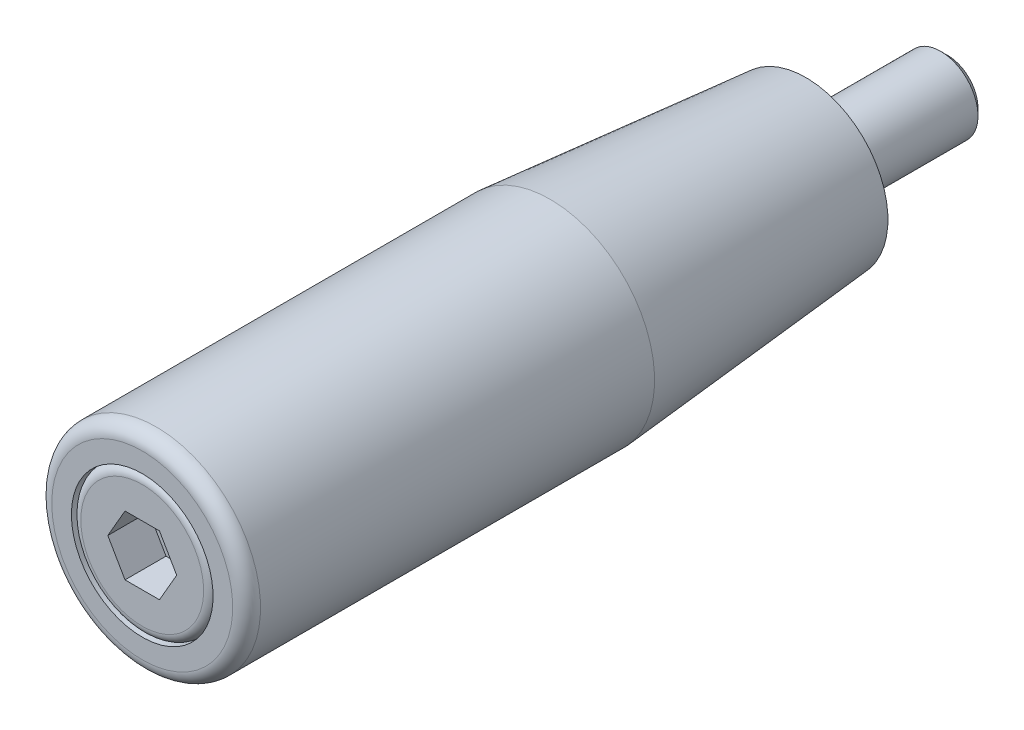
ISO-10303-21;
HEADER;
FILE_DESCRIPTION(('STEP AP214'),'2;1');
FILE_NAME('part.step','',(''),(''),'','','');
FILE_SCHEMA(('AUTOMOTIVE_DESIGN { 1 0 10303 214 1 1 1 1 }'));
ENDSEC;
DATA;
#1=APPLICATION_CONTEXT('core data for automotive mechanical design processes');
#2=APPLICATION_PROTOCOL_DEFINITION('international standard','automotive_design',2000,#1);
#3=PRODUCT_CONTEXT('',#1,'mechanical');
#4=PRODUCT('Part','Part','',(#3));
#5=PRODUCT_RELATED_PRODUCT_CATEGORY('part','',(#4));
#6=PRODUCT_DEFINITION_FORMATION('','',#4);
#7=PRODUCT_DEFINITION_CONTEXT('part definition',#1,'design');
#8=PRODUCT_DEFINITION('design','',#6,#7);
#9=PRODUCT_DEFINITION_SHAPE('','',#8);
#10=(LENGTH_UNIT() NAMED_UNIT(*) SI_UNIT(.MILLI.,.METRE.));
#11=(NAMED_UNIT(*) PLANE_ANGLE_UNIT() SI_UNIT($,.RADIAN.));
#12=(NAMED_UNIT(*) SI_UNIT($,.STERADIAN.) SOLID_ANGLE_UNIT());
#13=UNCERTAINTY_MEASURE_WITH_UNIT(LENGTH_MEASURE(1.E-05),#10,'distance_accuracy_value','');
#14=(GEOMETRIC_REPRESENTATION_CONTEXT(3) GLOBAL_UNCERTAINTY_ASSIGNED_CONTEXT((#13)) GLOBAL_UNIT_ASSIGNED_CONTEXT((#10,
#11,#12)) REPRESENTATION_CONTEXT('',''));
#15=CARTESIAN_POINT('',(0.,0.,0.));
#16=DIRECTION('',(0.,0.,1.));
#17=DIRECTION('',(1.,0.,0.));
#18=AXIS2_PLACEMENT_3D('',#15,#16,#17);
#19=CARTESIAN_POINT('',(0.,-4.,0.));
#20=DIRECTION('',(0.,0.,1.));
#21=DIRECTION('',(-1.,0.,0.));
#22=AXIS2_PLACEMENT_3D('',#19,#20,#21);
#23=PLANE('',#22);
#24=CARTESIAN_POINT('',(0.,0.,0.));
#25=DIRECTION('',(0.,0.,1.));
#26=DIRECTION('',(-1.,0.,0.));
#27=AXIS2_PLACEMENT_3D('',#24,#25,#26);
#28=CIRCLE('',#27,7.);
#29=CARTESIAN_POINT('',(-7.,0.,0.));
#30=VERTEX_POINT('',#29);
#31=EDGE_CURVE('E121',#30,#30,#28,.T.);
#32=ORIENTED_EDGE('',*,*,#31,.F.);
#33=EDGE_LOOP('',(#32));
#34=FACE_BOUND('',#33,.T.);
#35=CARTESIAN_POINT('',(0.,0.,0.));
#36=DIRECTION('',(0.,0.,1.));
#37=DIRECTION('',(-1.,0.,0.));
#38=AXIS2_PLACEMENT_3D('',#35,#36,#37);
#39=CIRCLE('',#38,4.);
#40=CARTESIAN_POINT('',(-4.,0.,0.));
#41=VERTEX_POINT('',#40);
#42=EDGE_CURVE('E124',#41,#41,#39,.T.);
#43=ORIENTED_EDGE('',*,*,#42,.T.);
#44=EDGE_LOOP('',(#43));
#45=FACE_BOUND('',#44,.T.);
#46=ADVANCED_FACE('F15',(#34,#45),#23,.F.);
#47=CARTESIAN_POINT('',(0.,-6.28466640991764E-13,90.));
#48=DIRECTION('',(0.,0.,1.));
#49=DIRECTION('',(-1.,0.,0.));
#50=AXIS2_PLACEMENT_3D('',#47,#48,#49);
#51=CYLINDRICAL_SURFACE('',#50,4.);
#52=ORIENTED_EDGE('',*,*,#42,.F.);
#53=EDGE_LOOP('',(#52));
#54=FACE_BOUND('',#53,.T.);
#55=CARTESIAN_POINT('',(0.,0.,-1.5));
#56=DIRECTION('',(0.,0.,1.));
#57=DIRECTION('',(-1.,0.,0.));
#58=AXIS2_PLACEMENT_3D('',#55,#56,#57);
#59=CIRCLE('',#58,4.);
#60=CARTESIAN_POINT('',(-4.,0.,-1.5));
#61=VERTEX_POINT('',#60);
#62=EDGE_CURVE('E127',#61,#61,#59,.T.);
#63=ORIENTED_EDGE('',*,*,#62,.T.);
#64=EDGE_LOOP('',(#63));
#65=FACE_BOUND('',#64,.T.);
#66=ADVANCED_FACE('F246',(#54,#65),#51,.T.);
#67=CARTESIAN_POINT('',(0.,-4.08,-1.50000000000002));
#68=DIRECTION('',(0.,0.,-1.));
#69=DIRECTION('',(1.,0.,0.));
#70=AXIS2_PLACEMENT_3D('',#67,#68,#69);
#71=PLANE('',#70);
#72=ORIENTED_EDGE('',*,*,#62,.F.);
#73=EDGE_LOOP('',(#72));
#74=FACE_BOUND('',#73,.T.);
#75=CARTESIAN_POINT('',(0.,0.,-1.5));
#76=DIRECTION('',(0.,0.,1.));
#77=DIRECTION('',(-1.,0.,0.));
#78=AXIS2_PLACEMENT_3D('',#75,#76,#77);
#79=CIRCLE('',#78,4.08);
#80=CARTESIAN_POINT('',(-4.08,0.,-1.5));
#81=VERTEX_POINT('',#80);
#82=EDGE_CURVE('E130',#81,#81,#79,.T.);
#83=ORIENTED_EDGE('',*,*,#82,.T.);
#84=EDGE_LOOP('',(#83));
#85=FACE_BOUND('',#84,.T.);
#86=ADVANCED_FACE('F242',(#74,#85),#71,.F.);
#87=CARTESIAN_POINT('',(0.,0.,-2.42));
#88=DIRECTION('',(0.,0.,-1.));
#89=DIRECTION('',(1.,0.,0.));
#90=AXIS2_PLACEMENT_3D('',#87,#88,#89);
#91=CONICAL_SURFACE('',#90,5.,0.785398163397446);
#92=ORIENTED_EDGE('',*,*,#82,.F.);
#93=EDGE_LOOP('',(#92));
#94=FACE_BOUND('',#93,.T.);
#95=CARTESIAN_POINT('',(0.,0.,-2.42));
#96=DIRECTION('',(0.,0.,1.));
#97=DIRECTION('',(-1.,0.,0.));
#98=AXIS2_PLACEMENT_3D('',#95,#96,#97);
#99=CIRCLE('',#98,5.);
#100=CARTESIAN_POINT('',(-5.,0.,-2.42));
#101=VERTEX_POINT('',#100);
#102=EDGE_CURVE('E133',#101,#101,#99,.T.);
#103=ORIENTED_EDGE('',*,*,#102,.T.);
#104=EDGE_LOOP('',(#103));
#105=FACE_BOUND('',#104,.T.);
#106=ADVANCED_FACE('F238',(#94,#105),#91,.T.);
#107=CARTESIAN_POINT('',(0.,-6.28466640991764E-13,90.));
#108=DIRECTION('',(0.,0.,1.));
#109=DIRECTION('',(-1.,0.,0.));
#110=AXIS2_PLACEMENT_3D('',#107,#108,#109);
#111=CYLINDRICAL_SURFACE('',#110,5.);
#112=ORIENTED_EDGE('',*,*,#102,.F.);
#113=EDGE_LOOP('',(#112));
#114=FACE_BOUND('',#113,.T.);
#115=CARTESIAN_POINT('',(0.,1.19269002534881E-13,-17.08));
#116=DIRECTION('',(0.,0.,1.));
#117=DIRECTION('',(-1.,0.,0.));
#118=AXIS2_PLACEMENT_3D('',#115,#116,#117);
#119=CIRCLE('',#118,5.);
#120=CARTESIAN_POINT('',(-5.,1.19269002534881E-13,-17.08));
#121=VERTEX_POINT('',#120);
#122=EDGE_CURVE('E136',#121,#121,#119,.T.);
#123=ORIENTED_EDGE('',*,*,#122,.T.);
#124=EDGE_LOOP('',(#123));
#125=FACE_BOUND('',#124,.T.);
#126=ADVANCED_FACE('F234',(#114,#125),#111,.T.);
#127=CARTESIAN_POINT('',(0.,1.25693328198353E-13,-18.));
#128=DIRECTION('',(0.,0.,1.));
#129=DIRECTION('',(-1.,0.,0.));
#130=AXIS2_PLACEMENT_3D('',#127,#128,#129);
#131=CONICAL_SURFACE('',#130,4.08,0.785398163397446);
#132=ORIENTED_EDGE('',*,*,#122,.F.);
#133=EDGE_LOOP('',(#132));
#134=FACE_BOUND('',#133,.T.);
#135=CARTESIAN_POINT('',(0.,1.25693328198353E-13,-18.));
#136=DIRECTION('',(0.,0.,1.));
#137=DIRECTION('',(-1.,0.,0.));
#138=AXIS2_PLACEMENT_3D('',#135,#136,#137);
#139=CIRCLE('',#138,4.08);
#140=CARTESIAN_POINT('',(-4.08,1.25693328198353E-13,-18.));
#141=VERTEX_POINT('',#140);
#142=EDGE_CURVE('E139',#141,#141,#139,.T.);
#143=ORIENTED_EDGE('',*,*,#142,.T.);
#144=EDGE_LOOP('',(#143));
#145=FACE_BOUND('',#144,.T.);
#146=ADVANCED_FACE('F230',(#134,#145),#131,.T.);
#147=CARTESIAN_POINT('',(0.,1.25693328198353E-13,-18.));
#148=DIRECTION('',(0.,0.,1.));
#149=DIRECTION('',(-1.,0.,0.));
#150=AXIS2_PLACEMENT_3D('',#147,#148,#149);
#151=PLANE('',#150);
#152=ORIENTED_EDGE('',*,*,#142,.F.);
#153=EDGE_LOOP('',(#152));
#154=FACE_BOUND('',#153,.T.);
#155=ADVANCED_FACE('F202',(#154),#151,.F.);
#156=CARTESIAN_POINT('',(0.,-6.28466640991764E-13,90.));
#157=DIRECTION('',(0.,0.,1.));
#158=DIRECTION('',(-1.,0.,0.));
#159=AXIS2_PLACEMENT_3D('',#156,#157,#158);
#160=CYLINDRICAL_SURFACE('',#159,7.);
#161=CARTESIAN_POINT('',(0.,0.,1.));
#162=DIRECTION('',(0.,0.,-1.));
#163=DIRECTION('',(1.,0.,0.));
#164=AXIS2_PLACEMENT_3D('',#161,#162,#163);
#165=CIRCLE('',#164,7.);
#166=CARTESIAN_POINT('',(7.,0.,1.));
#167=VERTEX_POINT('',#166);
#168=EDGE_CURVE('E9',#167,#167,#165,.T.);
#169=ORIENTED_EDGE('',*,*,#168,.T.);
#170=EDGE_LOOP('',(#169));
#171=FACE_BOUND('',#170,.T.);
#172=ORIENTED_EDGE('',*,*,#31,.T.);
#173=EDGE_LOOP('',(#172));
#174=FACE_BOUND('',#173,.T.);
#175=ADVANCED_FACE('F194',(#171,#174),#160,.T.);
#176=CARTESIAN_POINT('',(0.,-6.28466640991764E-13,90.));
#177=DIRECTION('',(0.,0.,1.));
#178=DIRECTION('',(-1.,0.,0.));
#179=AXIS2_PLACEMENT_3D('',#176,#177,#178);
#180=CYLINDRICAL_SURFACE('',#179,9.5);
#181=CARTESIAN_POINT('',(0.,-6.28466640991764E-13,90.));
#182=DIRECTION('',(0.,0.,1.));
#183=DIRECTION('',(-1.,0.,0.));
#184=AXIS2_PLACEMENT_3D('',#181,#182,#183);
#185=CIRCLE('',#184,9.5);
#186=CARTESIAN_POINT('',(-9.5,-6.28466640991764E-13,90.));
#187=VERTEX_POINT('',#186);
#188=EDGE_CURVE('E167',#187,#187,#185,.T.);
#189=ORIENTED_EDGE('',*,*,#188,.T.);
#190=EDGE_LOOP('',(#189));
#191=FACE_BOUND('',#190,.T.);
#192=CARTESIAN_POINT('',(0.,-6.1962155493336E-13,88.7333333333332));
#193=DIRECTION('',(0.,0.,1.));
#194=DIRECTION('',(-1.,0.,0.));
#195=AXIS2_PLACEMENT_3D('',#192,#193,#194);
#196=CIRCLE('',#195,9.5);
#197=CARTESIAN_POINT('',(-9.5,-6.1962155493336E-13,88.7333333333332));
#198=VERTEX_POINT('',#197);
#199=EDGE_CURVE('E112',#198,#198,#196,.T.);
#200=ORIENTED_EDGE('',*,*,#199,.F.);
#201=EDGE_LOOP('',(#200));
#202=FACE_BOUND('',#201,.T.);
#203=ADVANCED_FACE('F180',(#191,#202),#180,.F.);
#204=CARTESIAN_POINT('',(0.,-9.50000000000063,90.));
#205=DIRECTION('',(0.,0.,1.));
#206=DIRECTION('',(-1.,0.,0.));
#207=AXIS2_PLACEMENT_3D('',#204,#205,#206);
#208=PLANE('',#207);
#209=CARTESIAN_POINT('',(0.,-6.28466640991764E-13,90.));
#210=DIRECTION('',(0.,0.,1.));
#211=DIRECTION('',(-1.,0.,0.));
#212=AXIS2_PLACEMENT_3D('',#209,#210,#211);
#213=CIRCLE('',#212,12.1333333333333);
#214=CARTESIAN_POINT('',(-12.1333333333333,-6.28466640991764E-13,90.));
#215=VERTEX_POINT('',#214);
#216=EDGE_CURVE('E165',#215,#215,#213,.T.);
#217=ORIENTED_EDGE('',*,*,#216,.T.);
#218=EDGE_LOOP('',(#217));
#219=FACE_BOUND('',#218,.T.);
#220=ORIENTED_EDGE('',*,*,#188,.F.);
#221=EDGE_LOOP('',(#220));
#222=FACE_BOUND('',#221,.T.);
#223=ADVANCED_FACE('F211',(#219,#222),#208,.T.);
#224=CARTESIAN_POINT('',(0.,-6.1543177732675E-13,88.1333333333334));
#225=DIRECTION('',(0.,0.,1.));
#226=DIRECTION('',(-1.,0.,0.));
#227=AXIS2_PLACEMENT_3D('',#224,#225,#226);
#228=TOROIDAL_SURFACE('',#227,12.1333333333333,1.86666666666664);
#229=CARTESIAN_POINT('',(0.,-6.15431777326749E-13,88.1333333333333));
#230=DIRECTION('',(0.,0.,1.));
#231=DIRECTION('',(-1.,0.,0.));
#232=AXIS2_PLACEMENT_3D('',#229,#230,#231);
#233=CIRCLE('',#232,14.);
#234=CARTESIAN_POINT('',(-14.,-6.15431777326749E-13,88.1333333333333));
#235=VERTEX_POINT('',#234);
#236=EDGE_CURVE('E162',#235,#235,#233,.T.);
#237=ORIENTED_EDGE('',*,*,#236,.T.);
#238=EDGE_LOOP('',(#237));
#239=FACE_BOUND('',#238,.T.);
#240=ORIENTED_EDGE('',*,*,#216,.F.);
#241=EDGE_LOOP('',(#240));
#242=FACE_BOUND('',#241,.T.);
#243=ADVANCED_FACE('F214',(#239,#242),#228,.T.);
#244=CARTESIAN_POINT('',(0.,-11.,0.999999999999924));
#245=DIRECTION('',(0.,0.,-1.));
#246=DIRECTION('',(1.,0.,0.));
#247=AXIS2_PLACEMENT_3D('',#244,#245,#246);
#248=PLANE('',#247);
#249=ORIENTED_EDGE('',*,*,#168,.F.);
#250=EDGE_LOOP('',(#249));
#251=FACE_BOUND('',#250,.T.);
#252=CARTESIAN_POINT('',(0.,0.,1.));
#253=DIRECTION('',(0.,0.,1.));
#254=DIRECTION('',(-1.,0.,0.));
#255=AXIS2_PLACEMENT_3D('',#252,#253,#254);
#256=CIRCLE('',#255,11.);
#257=CARTESIAN_POINT('',(-11.,0.,1.));
#258=VERTEX_POINT('',#257);
#259=EDGE_CURVE('E156',#258,#258,#256,.T.);
#260=ORIENTED_EDGE('',*,*,#259,.F.);
#261=EDGE_LOOP('',(#260));
#262=FACE_BOUND('',#261,.T.);
#263=ADVANCED_FACE('F17',(#251,#262),#248,.T.);
#264=CARTESIAN_POINT('',(0.,-2.46429848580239E-13,35.290156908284));
#265=DIRECTION('',(0.,0.,1.));
#266=DIRECTION('',(-1.,0.,0.));
#267=AXIS2_PLACEMENT_3D('',#264,#265,#266);
#268=CONICAL_SURFACE('',#267,14.,0.0872664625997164);
#269=ORIENTED_EDGE('',*,*,#259,.T.);
#270=EDGE_LOOP('',(#269));
#271=FACE_BOUND('',#270,.T.);
#272=CARTESIAN_POINT('',(0.,-2.46429848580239E-13,35.290156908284));
#273=DIRECTION('',(0.,0.,1.));
#274=DIRECTION('',(-1.,0.,0.));
#275=AXIS2_PLACEMENT_3D('',#272,#273,#274);
#276=CIRCLE('',#275,14.);
#277=CARTESIAN_POINT('',(-14.,-2.46429848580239E-13,35.290156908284));
#278=VERTEX_POINT('',#277);
#279=EDGE_CURVE('E159',#278,#278,#276,.T.);
#280=ORIENTED_EDGE('',*,*,#279,.F.);
#281=EDGE_LOOP('',(#280));
#282=FACE_BOUND('',#281,.T.);
#283=ADVANCED_FACE('F223',(#271,#282),#268,.T.);
#284=CARTESIAN_POINT('',(0.,-6.28466640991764E-13,90.));
#285=DIRECTION('',(0.,0.,1.));
#286=DIRECTION('',(-1.,0.,0.));
#287=AXIS2_PLACEMENT_3D('',#284,#285,#286);
#288=CYLINDRICAL_SURFACE('',#287,14.);
#289=ORIENTED_EDGE('',*,*,#279,.T.);
#290=EDGE_LOOP('',(#289));
#291=FACE_BOUND('',#290,.T.);
#292=ORIENTED_EDGE('',*,*,#236,.F.);
#293=EDGE_LOOP('',(#292));
#294=FACE_BOUND('',#293,.T.);
#295=ADVANCED_FACE('F219',(#291,#294),#288,.T.);
#296=CARTESIAN_POINT('',(0.,-6.19621554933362E-13,88.7333333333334));
#297=DIRECTION('',(0.,0.,1.));
#298=DIRECTION('',(-1.,0.,0.));
#299=AXIS2_PLACEMENT_3D('',#296,#297,#298);
#300=TOROIDAL_SURFACE('',#299,8.23333333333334,1.26666666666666);
#301=ORIENTED_EDGE('',*,*,#199,.T.);
#302=EDGE_LOOP('',(#301));
#303=FACE_BOUND('',#302,.T.);
#304=CARTESIAN_POINT('',(0.,-6.28466640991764E-13,90.));
#305=DIRECTION('',(0.,0.,1.));
#306=DIRECTION('',(-1.,0.,0.));
#307=AXIS2_PLACEMENT_3D('',#304,#305,#306);
#308=CIRCLE('',#307,8.23333333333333);
#309=CARTESIAN_POINT('',(-8.23333333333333,-6.28466640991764E-13,90.));
#310=VERTEX_POINT('',#309);
#311=EDGE_CURVE('E85',#310,#310,#308,.T.);
#312=ORIENTED_EDGE('',*,*,#311,.F.);
#313=EDGE_LOOP('',(#312));
#314=FACE_BOUND('',#313,.T.);
#315=ADVANCED_FACE('F222',(#303,#314),#300,.T.);
#316=CARTESIAN_POINT('',(0.,-8.23333333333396,90.));
#317=DIRECTION('',(0.,0.,-1.));
#318=DIRECTION('',(1.,0.,0.));
#319=AXIS2_PLACEMENT_3D('',#316,#317,#318);
#320=PLANE('',#319);
#321=DIRECTION('',(1.,0.,0.));
#322=VECTOR('',#321,1.);
#323=CARTESIAN_POINT('',(0.,-4.00000000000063,90.));
#324=LINE('',#323,#322);
#325=CARTESIAN_POINT('',(-2.30940107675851,-4.00000000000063,90.));
#326=VERTEX_POINT('',#325);
#327=CARTESIAN_POINT('',(2.30940107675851,-4.00000000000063,90.));
#328=VERTEX_POINT('',#327);
#329=EDGE_CURVE('E146',#326,#328,#324,.T.);
#330=ORIENTED_EDGE('',*,*,#329,.F.);
#331=DIRECTION('',(0.5,-0.866025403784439,0.));
#332=VECTOR('',#331,1.);
#333=CARTESIAN_POINT('',(0.101036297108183,-8.17500000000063,90.));
#334=LINE('',#333,#332);
#335=CARTESIAN_POINT('',(-4.61880215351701,-6.28466640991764E-13,90.));
#336=VERTEX_POINT('',#335);
#337=EDGE_CURVE('E148',#336,#326,#334,.T.);
#338=ORIENTED_EDGE('',*,*,#337,.F.);
#339=DIRECTION('',(-0.5,-0.866025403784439,0.));
#340=VECTOR('',#339,1.);
#341=CARTESIAN_POINT('',(-7.0292395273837,-4.17500000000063,90.));
#342=LINE('',#341,#340);
#343=CARTESIAN_POINT('',(-2.30940107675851,3.99999999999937,90.));
#344=VERTEX_POINT('',#343);
#345=EDGE_CURVE('E151',#344,#336,#342,.T.);
#346=ORIENTED_EDGE('',*,*,#345,.F.);
#347=DIRECTION('',(-1.,0.,0.));
#348=VECTOR('',#347,1.);
#349=CARTESIAN_POINT('',(0.,3.99999999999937,90.));
#350=LINE('',#349,#348);
#351=CARTESIAN_POINT('',(2.30940107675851,3.99999999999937,90.));
#352=VERTEX_POINT('',#351);
#353=EDGE_CURVE('E41',#352,#344,#350,.T.);
#354=ORIENTED_EDGE('',*,*,#353,.F.);
#355=DIRECTION('',(-0.5,0.866025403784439,0.));
#356=VECTOR('',#355,1.);
#357=CARTESIAN_POINT('',(7.0292395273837,-4.17500000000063,90.));
#358=LINE('',#357,#356);
#359=CARTESIAN_POINT('',(4.61880215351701,-6.28466640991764E-13,90.));
#360=VERTEX_POINT('',#359);
#361=EDGE_CURVE('E142',#360,#352,#358,.T.);
#362=ORIENTED_EDGE('',*,*,#361,.F.);
#363=DIRECTION('',(0.5,0.866025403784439,0.));
#364=VECTOR('',#363,1.);
#365=CARTESIAN_POINT('',(-0.101036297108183,-8.17500000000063,90.));
#366=LINE('',#365,#364);
#367=EDGE_CURVE('E144',#328,#360,#366,.T.);
#368=ORIENTED_EDGE('',*,*,#367,.F.);
#369=EDGE_LOOP('',(#330,#338,#346,#354,#362,#368));
#370=FACE_BOUND('',#369,.T.);
#371=ORIENTED_EDGE('',*,*,#311,.T.);
#372=EDGE_LOOP('',(#371));
#373=FACE_BOUND('',#372,.T.);
#374=ADVANCED_FACE('F273',(#370,#373),#320,.F.);
#375=CARTESIAN_POINT('',(-2.30940107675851,-4.00000000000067,95.5));
#376=DIRECTION('',(0.,1.,0.));
#377=DIRECTION('',(-1.,0.,0.));
#378=AXIS2_PLACEMENT_3D('',#375,#376,#377);
#379=PLANE('',#378);
#380=DIRECTION('',(0.,0.,-1.));
#381=VECTOR('',#380,1.);
#382=CARTESIAN_POINT('',(-2.30940107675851,-4.00000000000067,95.5));
#383=LINE('',#382,#381);
#384=CARTESIAN_POINT('',(-2.30940107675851,-4.00000000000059,84.5));
#385=VERTEX_POINT('',#384);
#386=EDGE_CURVE('E106',#326,#385,#383,.T.);
#387=ORIENTED_EDGE('',*,*,#386,.F.);
#388=ORIENTED_EDGE('',*,*,#329,.T.);
#389=DIRECTION('',(0.,0.,-1.));
#390=VECTOR('',#389,1.);
#391=CARTESIAN_POINT('',(2.30940107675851,-4.00000000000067,95.5));
#392=LINE('',#391,#390);
#393=CARTESIAN_POINT('',(2.30940107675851,-4.00000000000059,84.5));
#394=VERTEX_POINT('',#393);
#395=EDGE_CURVE('E103',#328,#394,#392,.T.);
#396=ORIENTED_EDGE('',*,*,#395,.T.);
#397=DIRECTION('',(1.,0.,0.));
#398=VECTOR('',#397,1.);
#399=CARTESIAN_POINT('',(-2.30940107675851,-4.00000000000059,84.5));
#400=LINE('',#399,#398);
#401=EDGE_CURVE('E93',#385,#394,#400,.T.);
#402=ORIENTED_EDGE('',*,*,#401,.F.);
#403=EDGE_LOOP('',(#387,#388,#396,#402));
#404=FACE_BOUND('',#403,.T.);
#405=ADVANCED_FACE('F269',(#404),#379,.T.);
#406=CARTESIAN_POINT('',(-4.61880215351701,-6.66872935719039E-13,95.5));
#407=DIRECTION('',(0.866025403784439,0.5,0.));
#408=DIRECTION('',(-0.5,0.866025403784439,0.));
#409=AXIS2_PLACEMENT_3D('',#406,#407,#408);
#410=PLANE('',#409);
#411=ORIENTED_EDGE('',*,*,#337,.T.);
#412=ORIENTED_EDGE('',*,*,#386,.T.);
#413=DIRECTION('',(0.5,-0.866025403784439,0.));
#414=VECTOR('',#413,1.);
#415=CARTESIAN_POINT('',(-4.61880215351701,-5.9006034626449E-13,84.5));
#416=LINE('',#415,#414);
#417=CARTESIAN_POINT('',(-4.61880215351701,-5.9006034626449E-13,84.5));
#418=VERTEX_POINT('',#417);
#419=EDGE_CURVE('E91',#418,#385,#416,.T.);
#420=ORIENTED_EDGE('',*,*,#419,.F.);
#421=DIRECTION('',(0.,0.,-1.));
#422=VECTOR('',#421,1.);
#423=CARTESIAN_POINT('',(-4.61880215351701,-6.66872935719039E-13,95.5));
#424=LINE('',#423,#422);
#425=EDGE_CURVE('E86',#336,#418,#424,.T.);
#426=ORIENTED_EDGE('',*,*,#425,.F.);
#427=EDGE_LOOP('',(#411,#412,#420,#426));
#428=FACE_BOUND('',#427,.T.);
#429=ADVANCED_FACE('F272',(#428),#410,.T.);
#430=CARTESIAN_POINT('',(-2.30940107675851,3.99999999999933,95.5));
#431=DIRECTION('',(0.866025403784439,-0.5,0.));
#432=DIRECTION('',(0.5,0.866025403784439,0.));
#433=AXIS2_PLACEMENT_3D('',#430,#431,#432);
#434=PLANE('',#433);
#435=ORIENTED_EDGE('',*,*,#345,.T.);
#436=ORIENTED_EDGE('',*,*,#425,.T.);
#437=DIRECTION('',(-0.5,-0.866025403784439,0.));
#438=VECTOR('',#437,1.);
#439=CARTESIAN_POINT('',(-2.30940107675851,3.99999999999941,84.5));
#440=LINE('',#439,#438);
#441=CARTESIAN_POINT('',(-2.30940107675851,3.99999999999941,84.5));
#442=VERTEX_POINT('',#441);
#443=EDGE_CURVE('E76',#442,#418,#440,.T.);
#444=ORIENTED_EDGE('',*,*,#443,.F.);
#445=DIRECTION('',(0.,0.,-1.));
#446=VECTOR('',#445,1.);
#447=CARTESIAN_POINT('',(-2.30940107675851,3.99999999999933,95.5));
#448=LINE('',#447,#446);
#449=EDGE_CURVE('E81',#344,#442,#448,.T.);
#450=ORIENTED_EDGE('',*,*,#449,.F.);
#451=EDGE_LOOP('',(#435,#436,#444,#450));
#452=FACE_BOUND('',#451,.T.);
#453=ADVANCED_FACE('F88',(#452),#434,.T.);
#454=CARTESIAN_POINT('',(2.30940107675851,3.99999999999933,95.5));
#455=DIRECTION('',(0.,-1.,0.));
#456=DIRECTION('',(1.,0.,0.));
#457=AXIS2_PLACEMENT_3D('',#454,#455,#456);
#458=PLANE('',#457);
#459=ORIENTED_EDGE('',*,*,#353,.T.);
#460=ORIENTED_EDGE('',*,*,#449,.T.);
#461=DIRECTION('',(-1.,0.,0.));
#462=VECTOR('',#461,1.);
#463=CARTESIAN_POINT('',(2.30940107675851,3.99999999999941,84.5));
#464=LINE('',#463,#462);
#465=CARTESIAN_POINT('',(2.30940107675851,3.99999999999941,84.5));
#466=VERTEX_POINT('',#465);
#467=EDGE_CURVE('E73',#466,#442,#464,.T.);
#468=ORIENTED_EDGE('',*,*,#467,.F.);
#469=DIRECTION('',(0.,0.,-1.));
#470=VECTOR('',#469,1.);
#471=CARTESIAN_POINT('',(2.30940107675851,3.99999999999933,95.5));
#472=LINE('',#471,#470);
#473=EDGE_CURVE('E100',#352,#466,#472,.T.);
#474=ORIENTED_EDGE('',*,*,#473,.F.);
#475=EDGE_LOOP('',(#459,#460,#468,#474));
#476=FACE_BOUND('',#475,.T.);
#477=ADVANCED_FACE('F82',(#476),#458,.T.);
#478=CARTESIAN_POINT('',(4.61880215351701,-6.66872935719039E-13,95.5));
#479=DIRECTION('',(-0.866025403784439,-0.5,0.));
#480=DIRECTION('',(0.5,-0.866025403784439,0.));
#481=AXIS2_PLACEMENT_3D('',#478,#479,#480);
#482=PLANE('',#481);
#483=ORIENTED_EDGE('',*,*,#361,.T.);
#484=ORIENTED_EDGE('',*,*,#473,.T.);
#485=DIRECTION('',(-0.5,0.866025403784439,0.));
#486=VECTOR('',#485,1.);
#487=CARTESIAN_POINT('',(4.61880215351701,-5.9006034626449E-13,84.5));
#488=LINE('',#487,#486);
#489=CARTESIAN_POINT('',(4.61880215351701,-5.9006034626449E-13,84.5));
#490=VERTEX_POINT('',#489);
#491=EDGE_CURVE('E78',#490,#466,#488,.T.);
#492=ORIENTED_EDGE('',*,*,#491,.F.);
#493=DIRECTION('',(0.,0.,-1.));
#494=VECTOR('',#493,1.);
#495=CARTESIAN_POINT('',(4.61880215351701,-6.66872935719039E-13,95.5));
#496=LINE('',#495,#494);
#497=EDGE_CURVE('E33',#360,#490,#496,.T.);
#498=ORIENTED_EDGE('',*,*,#497,.F.);
#499=EDGE_LOOP('',(#483,#484,#492,#498));
#500=FACE_BOUND('',#499,.T.);
#501=ADVANCED_FACE('F263',(#500),#482,.T.);
#502=CARTESIAN_POINT('',(2.30940107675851,-4.00000000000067,95.5));
#503=DIRECTION('',(-0.866025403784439,0.5,0.));
#504=DIRECTION('',(-0.5,-0.866025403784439,0.));
#505=AXIS2_PLACEMENT_3D('',#502,#503,#504);
#506=PLANE('',#505);
#507=ORIENTED_EDGE('',*,*,#367,.T.);
#508=ORIENTED_EDGE('',*,*,#497,.T.);
#509=DIRECTION('',(0.5,0.866025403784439,0.));
#510=VECTOR('',#509,1.);
#511=CARTESIAN_POINT('',(2.30940107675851,-4.00000000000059,84.5));
#512=LINE('',#511,#510);
#513=EDGE_CURVE('E97',#394,#490,#512,.T.);
#514=ORIENTED_EDGE('',*,*,#513,.F.);
#515=ORIENTED_EDGE('',*,*,#395,.F.);
#516=EDGE_LOOP('',(#507,#508,#514,#515));
#517=FACE_BOUND('',#516,.T.);
#518=ADVANCED_FACE('F257',(#517),#506,.T.);
#519=CARTESIAN_POINT('',(0.,-5.9006034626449E-13,84.5));
#520=DIRECTION('',(0.,0.,1.));
#521=DIRECTION('',(-1.,0.,0.));
#522=AXIS2_PLACEMENT_3D('',#519,#520,#521);
#523=PLANE('',#522);
#524=ORIENTED_EDGE('',*,*,#419,.T.);
#525=ORIENTED_EDGE('',*,*,#401,.T.);
#526=ORIENTED_EDGE('',*,*,#513,.T.);
#527=ORIENTED_EDGE('',*,*,#491,.T.);
#528=ORIENTED_EDGE('',*,*,#467,.T.);
#529=ORIENTED_EDGE('',*,*,#443,.T.);
#530=EDGE_LOOP('',(#524,#525,#526,#527,#528,#529));
#531=FACE_BOUND('',#530,.T.);
#532=ADVANCED_FACE('F74',(#531),#523,.T.);
#533=CLOSED_SHELL('',(#46,#66,#86,#106,#126,#146,#155,#175,#203,#223,#243,#263,#283,#295,#315,
#374,#405,#429,#453,#477,#501,#518,#532));
#534=CARTESIAN_POINT('',(0.,-5.58637014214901E-13,80.));
#535=DIRECTION('',(0.,0.,1.));
#536=DIRECTION('',(-1.,0.,0.));
#537=AXIS2_PLACEMENT_3D('',#534,#535,#536);
#538=CIRCLE('',#537,7.);
#539=CARTESIAN_POINT('',(-7.,-5.58637014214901E-13,80.));
#540=VERTEX_POINT('',#539);
#541=EDGE_CURVE('E25',#540,#540,#538,.T.);
#542=ORIENTED_EDGE('',*,*,#541,.T.);
#543=EDGE_LOOP('',(#542));
#544=FACE_BOUND('',#543,.T.);
#545=CARTESIAN_POINT('',(0.,-5.67714865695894E-13,81.3));
#546=DIRECTION('',(0.,0.,1.));
#547=DIRECTION('',(-1.,0.,0.));
#548=AXIS2_PLACEMENT_3D('',#545,#546,#547);
#549=CIRCLE('',#548,7.);
#550=CARTESIAN_POINT('',(-7.,-5.67714865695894E-13,81.3));
#551=VERTEX_POINT('',#550);
#552=EDGE_CURVE('E118',#551,#551,#549,.T.);
#553=ORIENTED_EDGE('',*,*,#552,.F.);
#554=EDGE_LOOP('',(#553));
#555=FACE_BOUND('',#554,.T.);
#556=ADVANCED_FACE('F181',(#544,#555),#160,.T.);
#557=CARTESIAN_POINT('',(0.,-7.00000000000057,81.3));
#558=DIRECTION('',(0.,0.,1.));
#559=DIRECTION('',(-1.,0.,0.));
#560=AXIS2_PLACEMENT_3D('',#557,#558,#559);
#561=PLANE('',#560);
#562=CARTESIAN_POINT('',(0.,-5.67714865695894E-13,81.3));
#563=DIRECTION('',(0.,0.,1.));
#564=DIRECTION('',(-1.,0.,0.));
#565=AXIS2_PLACEMENT_3D('',#562,#563,#564);
#566=CIRCLE('',#565,9.5);
#567=CARTESIAN_POINT('',(-9.5,-5.67714865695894E-13,81.3));
#568=VERTEX_POINT('',#567);
#569=EDGE_CURVE('E115',#568,#568,#566,.T.);
#570=ORIENTED_EDGE('',*,*,#569,.F.);
#571=EDGE_LOOP('',(#570));
#572=FACE_BOUND('',#571,.T.);
#573=ORIENTED_EDGE('',*,*,#552,.T.);
#574=EDGE_LOOP('',(#573));
#575=FACE_BOUND('',#574,.T.);
#576=ADVANCED_FACE('F185',(#572,#575),#561,.F.);
#577=CARTESIAN_POINT('',(0.,-7.00000000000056,80.));
#578=DIRECTION('',(0.,0.,1.));
#579=DIRECTION('',(-1.,0.,0.));
#580=AXIS2_PLACEMENT_3D('',#577,#578,#579);
#581=PLANE('',#580);
#582=ORIENTED_EDGE('',*,*,#541,.F.);
#583=EDGE_LOOP('',(#582));
#584=FACE_BOUND('',#583,.T.);
#585=CARTESIAN_POINT('',(0.,-5.58637014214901E-13,80.));
#586=DIRECTION('',(0.,0.,1.));
#587=DIRECTION('',(-1.,0.,0.));
#588=AXIS2_PLACEMENT_3D('',#585,#586,#587);
#589=CIRCLE('',#588,9.5);
#590=CARTESIAN_POINT('',(-9.5,-5.58637014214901E-13,80.));
#591=VERTEX_POINT('',#590);
#592=EDGE_CURVE('E19',#591,#591,#589,.T.);
#593=ORIENTED_EDGE('',*,*,#592,.T.);
#594=EDGE_LOOP('',(#593));
#595=FACE_BOUND('',#594,.T.);
#596=ADVANCED_FACE('F174',(#584,#595),#581,.T.);
#597=ORIENTED_EDGE('',*,*,#592,.F.);
#598=EDGE_LOOP('',(#597));
#599=FACE_BOUND('',#598,.T.);
#600=ORIENTED_EDGE('',*,*,#569,.T.);
#601=EDGE_LOOP('',(#600));
#602=FACE_BOUND('',#601,.T.);
#603=ADVANCED_FACE('F176',(#599,#602),#180,.F.);
#604=CLOSED_SHELL('',(#556,#576,#596,#603));
#605=ORIENTED_CLOSED_SHELL('',*,#604,.T.);
#606=BREP_WITH_VOIDS('B1',#533,(#605));
#607=ADVANCED_BREP_SHAPE_REPRESENTATION('',(#18,#606),#14);
#608=SHAPE_DEFINITION_REPRESENTATION(#9,#607);
ENDSEC;
END-ISO-10303-21;
